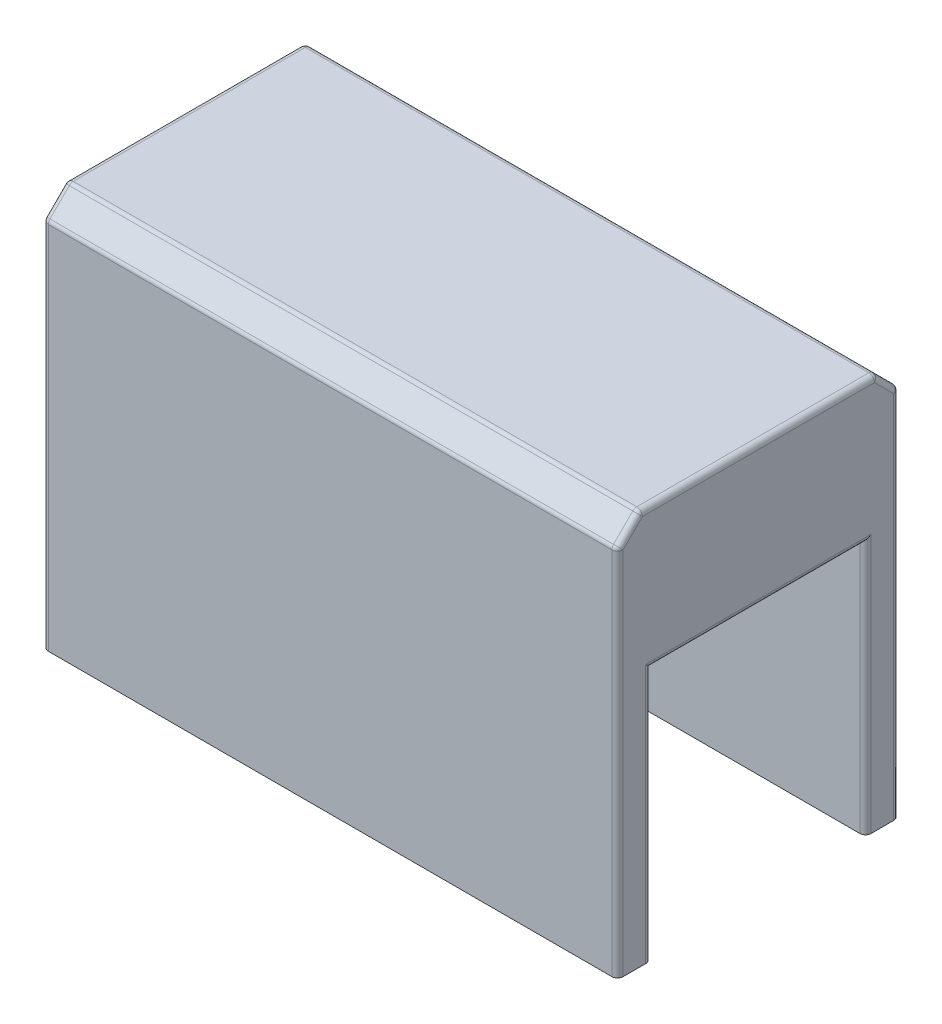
ISO-10303-21;
HEADER;
FILE_DESCRIPTION(('STEP AP214'),'2;1');
FILE_NAME('part.step','',(''),(''),'','','');
FILE_SCHEMA(('AUTOMOTIVE_DESIGN { 1 0 10303 214 1 1 1 1 }'));
ENDSEC;
DATA;
#1=APPLICATION_CONTEXT('core data for automotive mechanical design processes');
#2=APPLICATION_PROTOCOL_DEFINITION('international standard','automotive_design',2000,#1);
#3=PRODUCT_CONTEXT('',#1,'mechanical');
#4=PRODUCT('Part','Part','',(#3));
#5=PRODUCT_RELATED_PRODUCT_CATEGORY('part','',(#4));
#6=PRODUCT_DEFINITION_FORMATION('','',#4);
#7=PRODUCT_DEFINITION_CONTEXT('part definition',#1,'design');
#8=PRODUCT_DEFINITION('design','',#6,#7);
#9=PRODUCT_DEFINITION_SHAPE('','',#8);
#10=(LENGTH_UNIT() NAMED_UNIT(*) SI_UNIT(.MILLI.,.METRE.));
#11=(NAMED_UNIT(*) PLANE_ANGLE_UNIT() SI_UNIT($,.RADIAN.));
#12=(NAMED_UNIT(*) SI_UNIT($,.STERADIAN.) SOLID_ANGLE_UNIT());
#13=UNCERTAINTY_MEASURE_WITH_UNIT(LENGTH_MEASURE(1.E-05),#10,'distance_accuracy_value','');
#14=(GEOMETRIC_REPRESENTATION_CONTEXT(3) GLOBAL_UNCERTAINTY_ASSIGNED_CONTEXT((#13)) GLOBAL_UNIT_ASSIGNED_CONTEXT((#10,
#11,#12)) REPRESENTATION_CONTEXT('',''));
#15=CARTESIAN_POINT('',(0.,0.,0.));
#16=DIRECTION('',(0.,0.,1.));
#17=DIRECTION('',(1.,0.,0.));
#18=AXIS2_PLACEMENT_3D('',#15,#16,#17);
#19=CARTESIAN_POINT('',(-510.,450.,190.));
#20=DIRECTION('',(0.,-1.,0.));
#21=DIRECTION('',(0.,0.,-1.));
#22=AXIS2_PLACEMENT_3D('',#19,#20,#21);
#23=PLANE('',#22);
#24=DIRECTION('',(1.,0.,0.));
#25=VECTOR('',#24,1.);
#26=CARTESIAN_POINT('',(-510.,450.,-190.));
#27=LINE('',#26,#25);
#28=CARTESIAN_POINT('',(-500.,450.,-190.));
#29=VERTEX_POINT('',#28);
#30=CARTESIAN_POINT('',(-450.,450.,-190.));
#31=VERTEX_POINT('',#30);
#32=EDGE_CURVE('E265',#29,#31,#27,.T.);
#33=ORIENTED_EDGE('',*,*,#32,.T.);
#34=DIRECTION('',(0.,0.,1.));
#35=VECTOR('',#34,1.);
#36=CARTESIAN_POINT('',(-450.,450.,190.));
#37=LINE('',#36,#35);
#38=CARTESIAN_POINT('',(-450.,450.,190.));
#39=VERTEX_POINT('',#38);
#40=EDGE_CURVE('E252',#31,#39,#37,.T.);
#41=ORIENTED_EDGE('',*,*,#40,.T.);
#42=DIRECTION('',(1.,0.,0.));
#43=VECTOR('',#42,1.);
#44=CARTESIAN_POINT('',(-510.,450.,190.));
#45=LINE('',#44,#43);
#46=CARTESIAN_POINT('',(-500.,450.,190.));
#47=VERTEX_POINT('',#46);
#48=EDGE_CURVE('E247',#47,#39,#45,.T.);
#49=ORIENTED_EDGE('',*,*,#48,.F.);
#50=DIRECTION('',(0.,0.,-1.));
#51=VECTOR('',#50,1.);
#52=CARTESIAN_POINT('',(-500.,450.,-190.));
#53=LINE('',#52,#51);
#54=EDGE_CURVE('E316',#47,#29,#53,.T.);
#55=ORIENTED_EDGE('',*,*,#54,.T.);
#56=EDGE_LOOP('',(#33,#41,#49,#55));
#57=FACE_BOUND('',#56,.T.);
#58=ADVANCED_FACE('F40',(#57),#23,.T.);
#59=CARTESIAN_POINT('',(450.,450.,190.));
#60=VERTEX_POINT('',#59);
#61=CARTESIAN_POINT('',(500.,450.,190.));
#62=VERTEX_POINT('',#61);
#63=EDGE_CURVE('E264',#60,#62,#45,.T.);
#64=ORIENTED_EDGE('',*,*,#63,.F.);
#65=DIRECTION('',(0.,0.,-1.));
#66=VECTOR('',#65,1.);
#67=CARTESIAN_POINT('',(450.,450.,190.));
#68=LINE('',#67,#66);
#69=CARTESIAN_POINT('',(450.,450.,-190.));
#70=VERTEX_POINT('',#69);
#71=EDGE_CURVE('E248',#60,#70,#68,.T.);
#72=ORIENTED_EDGE('',*,*,#71,.T.);
#73=CARTESIAN_POINT('',(500.,450.,-190.));
#74=VERTEX_POINT('',#73);
#75=EDGE_CURVE('E268',#70,#74,#27,.T.);
#76=ORIENTED_EDGE('',*,*,#75,.T.);
#77=DIRECTION('',(0.,0.,-1.));
#78=VECTOR('',#77,1.);
#79=CARTESIAN_POINT('',(500.,450.,190.));
#80=LINE('',#79,#78);
#81=EDGE_CURVE('E318',#74,#62,#80,.F.);
#82=ORIENTED_EDGE('',*,*,#81,.T.);
#83=EDGE_LOOP('',(#64,#72,#76,#82));
#84=FACE_BOUND('',#83,.T.);
#85=ADVANCED_FACE('F581',(#84),#23,.T.);
#86=CARTESIAN_POINT('',(0.,0.,0.));
#87=DIRECTION('',(0.,1.,0.));
#88=DIRECTION('',(0.,0.,1.));
#89=AXIS2_PLACEMENT_3D('',#86,#87,#88);
#90=PLANE('',#89);
#91=DIRECTION('',(-1.,0.,0.));
#92=VECTOR('',#91,1.);
#93=CARTESIAN_POINT('',(-510.,0.,-250.));
#94=LINE('',#93,#92);
#95=CARTESIAN_POINT('',(500.,0.,-250.));
#96=VERTEX_POINT('',#95);
#97=CARTESIAN_POINT('',(-500.,0.,-250.));
#98=VERTEX_POINT('',#97);
#99=EDGE_CURVE('E275',#96,#98,#94,.T.);
#100=ORIENTED_EDGE('',*,*,#99,.F.);
#101=CARTESIAN_POINT('',(500.,0.,-240.));
#102=DIRECTION('',(0.,1.,0.));
#103=DIRECTION('',(0.,0.,1.));
#104=AXIS2_PLACEMENT_3D('',#101,#102,#103);
#105=CIRCLE('',#104,10.);
#106=CARTESIAN_POINT('',(510.,0.,-240.));
#107=VERTEX_POINT('',#106);
#108=EDGE_CURVE('E297',#96,#107,#105,.F.);
#109=ORIENTED_EDGE('',*,*,#108,.T.);
#110=DIRECTION('',(0.,0.,-1.));
#111=VECTOR('',#110,1.);
#112=CARTESIAN_POINT('',(510.,0.,-250.));
#113=LINE('',#112,#111);
#114=CARTESIAN_POINT('',(510.,0.,-200.));
#115=VERTEX_POINT('',#114);
#116=EDGE_CURVE('E262',#115,#107,#113,.T.);
#117=ORIENTED_EDGE('',*,*,#116,.F.);
#118=CARTESIAN_POINT('',(500.,0.,-200.));
#119=DIRECTION('',(0.,1.,0.));
#120=DIRECTION('',(0.,0.,1.));
#121=AXIS2_PLACEMENT_3D('',#118,#119,#120);
#122=CIRCLE('',#121,10.);
#123=CARTESIAN_POINT('',(500.,0.,-190.));
#124=VERTEX_POINT('',#123);
#125=EDGE_CURVE('E294',#115,#124,#122,.F.);
#126=ORIENTED_EDGE('',*,*,#125,.T.);
#127=DIRECTION('',(1.,0.,0.));
#128=VECTOR('',#127,1.);
#129=CARTESIAN_POINT('',(-510.,0.,-190.));
#130=LINE('',#129,#128);
#131=CARTESIAN_POINT('',(-500.,0.,-190.));
#132=VERTEX_POINT('',#131);
#133=EDGE_CURVE('E269',#132,#124,#130,.T.);
#134=ORIENTED_EDGE('',*,*,#133,.F.);
#135=CARTESIAN_POINT('',(-500.,0.,-200.));
#136=DIRECTION('',(0.,1.,0.));
#137=DIRECTION('',(0.,0.,1.));
#138=AXIS2_PLACEMENT_3D('',#135,#136,#137);
#139=CIRCLE('',#138,10.);
#140=CARTESIAN_POINT('',(-510.,0.,-200.));
#141=VERTEX_POINT('',#140);
#142=EDGE_CURVE('E292',#132,#141,#139,.F.);
#143=ORIENTED_EDGE('',*,*,#142,.T.);
#144=DIRECTION('',(0.,0.,1.));
#145=VECTOR('',#144,1.);
#146=CARTESIAN_POINT('',(-510.,0.,-250.));
#147=LINE('',#146,#145);
#148=CARTESIAN_POINT('',(-510.,0.,-240.));
#149=VERTEX_POINT('',#148);
#150=EDGE_CURVE('E281',#149,#141,#147,.T.);
#151=ORIENTED_EDGE('',*,*,#150,.F.);
#152=CARTESIAN_POINT('',(-500.,0.,-240.));
#153=DIRECTION('',(0.,1.,0.));
#154=DIRECTION('',(0.,0.,1.));
#155=AXIS2_PLACEMENT_3D('',#152,#153,#154);
#156=CIRCLE('',#155,10.);
#157=EDGE_CURVE('E290',#149,#98,#156,.F.);
#158=ORIENTED_EDGE('',*,*,#157,.T.);
#159=EDGE_LOOP('',(#100,#109,#117,#126,#134,#143,#151,#158));
#160=FACE_BOUND('',#159,.T.);
#161=ADVANCED_FACE('F554',(#160),#90,.F.);
#162=CARTESIAN_POINT('',(510.,700.,-250.));
#163=DIRECTION('',(-1.,0.,0.));
#164=DIRECTION('',(0.,0.,1.));
#165=AXIS2_PLACEMENT_3D('',#162,#163,#164);
#166=PLANE('',#165);
#167=DIRECTION('',(0.,-1.,0.));
#168=VECTOR('',#167,1.);
#169=CARTESIAN_POINT('',(510.,700.,-240.));
#170=LINE('',#169,#168);
#171=CARTESIAN_POINT('',(510.,655.857864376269,-240.));
#172=VERTEX_POINT('',#171);
#173=EDGE_CURVE('E308',#107,#172,#170,.F.);
#174=ORIENTED_EDGE('',*,*,#173,.T.);
#175=DIRECTION('',(0.,0.707106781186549,0.707106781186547));
#176=VECTOR('',#175,1.);
#177=CARTESIAN_POINT('',(510.,692.928932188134,-202.928932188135));
#178=LINE('',#177,#176);
#179=CARTESIAN_POINT('',(510.,690.,-205.857864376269));
#180=VERTEX_POINT('',#179);
#181=EDGE_CURVE('E423',#172,#180,#178,.T.);
#182=ORIENTED_EDGE('',*,*,#181,.T.);
#183=DIRECTION('',(0.,0.,-1.));
#184=VECTOR('',#183,1.);
#185=CARTESIAN_POINT('',(510.,690.,195.857864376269));
#186=LINE('',#185,#184);
#187=CARTESIAN_POINT('',(510.,690.,205.857864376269));
#188=VERTEX_POINT('',#187);
#189=EDGE_CURVE('E421',#180,#188,#186,.F.);
#190=ORIENTED_EDGE('',*,*,#189,.T.);
#191=DIRECTION('',(0.,-0.707106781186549,0.707106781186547));
#192=VECTOR('',#191,1.);
#193=CARTESIAN_POINT('',(510.,662.928932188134,232.928932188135));
#194=LINE('',#193,#192);
#195=CARTESIAN_POINT('',(510.,655.857864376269,240.));
#196=VERTEX_POINT('',#195);
#197=EDGE_CURVE('E350',#188,#196,#194,.T.);
#198=ORIENTED_EDGE('',*,*,#197,.T.);
#199=DIRECTION('',(0.,-1.,0.));
#200=VECTOR('',#199,1.);
#201=CARTESIAN_POINT('',(510.,700.,240.));
#202=LINE('',#201,#200);
#203=CARTESIAN_POINT('',(510.,0.,240.));
#204=VERTEX_POINT('',#203);
#205=EDGE_CURVE('E299',#196,#204,#202,.T.);
#206=ORIENTED_EDGE('',*,*,#205,.T.);
#207=CARTESIAN_POINT('',(510.,0.,200.));
#208=VERTEX_POINT('',#207);
#209=EDGE_CURVE('E272',#204,#208,#113,.T.);
#210=ORIENTED_EDGE('',*,*,#209,.T.);
#211=DIRECTION('',(0.,-1.,0.));
#212=VECTOR('',#211,1.);
#213=CARTESIAN_POINT('',(510.,700.,200.));
#214=LINE('',#213,#212);
#215=CARTESIAN_POINT('',(510.,460.,200.));
#216=VERTEX_POINT('',#215);
#217=EDGE_CURVE('E301',#208,#216,#214,.F.);
#218=ORIENTED_EDGE('',*,*,#217,.T.);
#219=DIRECTION('',(0.,0.,-1.));
#220=VECTOR('',#219,1.);
#221=CARTESIAN_POINT('',(510.,460.,-190.));
#222=LINE('',#221,#220);
#223=CARTESIAN_POINT('',(510.,460.,-200.));
#224=VERTEX_POINT('',#223);
#225=EDGE_CURVE('E303',#216,#224,#222,.T.);
#226=ORIENTED_EDGE('',*,*,#225,.T.);
#227=DIRECTION('',(0.,-1.,0.));
#228=VECTOR('',#227,1.);
#229=CARTESIAN_POINT('',(510.,0.,-200.));
#230=LINE('',#229,#228);
#231=EDGE_CURVE('E305',#224,#115,#230,.T.);
#232=ORIENTED_EDGE('',*,*,#231,.T.);
#233=ORIENTED_EDGE('',*,*,#116,.T.);
#234=EDGE_LOOP('',(#174,#182,#190,#198,#206,#210,#218,#226,#232,#233));
#235=FACE_BOUND('',#234,.T.);
#236=ADVANCED_FACE('F510',(#235),#166,.F.);
#237=CARTESIAN_POINT('',(-510.,700.,-250.));
#238=DIRECTION('',(0.,0.,1.));
#239=DIRECTION('',(1.,0.,0.));
#240=AXIS2_PLACEMENT_3D('',#237,#238,#239);
#241=PLANE('',#240);
#242=DIRECTION('',(0.,-1.,0.));
#243=VECTOR('',#242,1.);
#244=CARTESIAN_POINT('',(-500.,700.,-250.));
#245=LINE('',#244,#243);
#246=CARTESIAN_POINT('',(-500.,655.857864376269,-250.));
#247=VERTEX_POINT('',#246);
#248=EDGE_CURVE('E285',#98,#247,#245,.F.);
#249=ORIENTED_EDGE('',*,*,#248,.T.);
#250=DIRECTION('',(1.,0.,0.));
#251=VECTOR('',#250,1.);
#252=CARTESIAN_POINT('',(500.,655.857864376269,-250.));
#253=LINE('',#252,#251);
#254=CARTESIAN_POINT('',(500.,655.857864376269,-250.));
#255=VERTEX_POINT('',#254);
#256=EDGE_CURVE('E11',#247,#255,#253,.T.);
#257=ORIENTED_EDGE('',*,*,#256,.T.);
#258=DIRECTION('',(0.,-1.,0.));
#259=VECTOR('',#258,1.);
#260=CARTESIAN_POINT('',(500.,700.,-250.));
#261=LINE('',#260,#259);
#262=EDGE_CURVE('E288',#255,#96,#261,.T.);
#263=ORIENTED_EDGE('',*,*,#262,.T.);
#264=ORIENTED_EDGE('',*,*,#99,.T.);
#265=EDGE_LOOP('',(#249,#257,#263,#264));
#266=FACE_BOUND('',#265,.T.);
#267=ADVANCED_FACE('F561',(#266),#241,.F.);
#268=CARTESIAN_POINT('',(-510.,700.,-250.));
#269=DIRECTION('',(1.,0.,0.));
#270=DIRECTION('',(0.,0.,-1.));
#271=AXIS2_PLACEMENT_3D('',#268,#269,#270);
#272=PLANE('',#271);
#273=DIRECTION('',(0.,0.,1.));
#274=VECTOR('',#273,1.);
#275=CARTESIAN_POINT('',(-510.,690.,-210.));
#276=LINE('',#275,#274);
#277=CARTESIAN_POINT('',(-510.,690.,205.857864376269));
#278=VERTEX_POINT('',#277);
#279=CARTESIAN_POINT('',(-510.,690.,-205.857864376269));
#280=VERTEX_POINT('',#279);
#281=EDGE_CURVE('E406',#278,#280,#276,.F.);
#282=ORIENTED_EDGE('',*,*,#281,.T.);
#283=DIRECTION('',(0.,-0.707106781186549,-0.707106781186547));
#284=VECTOR('',#283,1.);
#285=CARTESIAN_POINT('',(-510.,662.928932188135,-232.928932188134));
#286=LINE('',#285,#284);
#287=CARTESIAN_POINT('',(-510.,655.857864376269,-240.));
#288=VERTEX_POINT('',#287);
#289=EDGE_CURVE('E408',#280,#288,#286,.T.);
#290=ORIENTED_EDGE('',*,*,#289,.T.);
#291=DIRECTION('',(0.,-1.,0.));
#292=VECTOR('',#291,1.);
#293=CARTESIAN_POINT('',(-510.,700.,-240.));
#294=LINE('',#293,#292);
#295=EDGE_CURVE('E345',#288,#149,#294,.T.);
#296=ORIENTED_EDGE('',*,*,#295,.T.);
#297=ORIENTED_EDGE('',*,*,#150,.T.);
#298=DIRECTION('',(0.,-1.,0.));
#299=VECTOR('',#298,1.);
#300=CARTESIAN_POINT('',(-510.,450.,-200.));
#301=LINE('',#300,#299);
#302=CARTESIAN_POINT('',(-510.,460.,-200.));
#303=VERTEX_POINT('',#302);
#304=EDGE_CURVE('E340',#141,#303,#301,.F.);
#305=ORIENTED_EDGE('',*,*,#304,.T.);
#306=DIRECTION('',(0.,0.,-1.));
#307=VECTOR('',#306,1.);
#308=CARTESIAN_POINT('',(-510.,460.,190.));
#309=LINE('',#308,#307);
#310=CARTESIAN_POINT('',(-510.,460.,200.));
#311=VERTEX_POINT('',#310);
#312=EDGE_CURVE('E338',#303,#311,#309,.F.);
#313=ORIENTED_EDGE('',*,*,#312,.T.);
#314=DIRECTION('',(0.,-1.,0.));
#315=VECTOR('',#314,1.);
#316=CARTESIAN_POINT('',(-510.,700.,200.));
#317=LINE('',#316,#315);
#318=CARTESIAN_POINT('',(-510.,0.,200.));
#319=VERTEX_POINT('',#318);
#320=EDGE_CURVE('E342',#311,#319,#317,.T.);
#321=ORIENTED_EDGE('',*,*,#320,.T.);
#322=CARTESIAN_POINT('',(-510.,0.,240.));
#323=VERTEX_POINT('',#322);
#324=EDGE_CURVE('E278',#319,#323,#147,.T.);
#325=ORIENTED_EDGE('',*,*,#324,.T.);
#326=DIRECTION('',(0.,-1.,0.));
#327=VECTOR('',#326,1.);
#328=CARTESIAN_POINT('',(-510.,700.,240.));
#329=LINE('',#328,#327);
#330=CARTESIAN_POINT('',(-510.,655.857864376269,240.));
#331=VERTEX_POINT('',#330);
#332=EDGE_CURVE('E347',#323,#331,#329,.F.);
#333=ORIENTED_EDGE('',*,*,#332,.T.);
#334=DIRECTION('',(0.,0.707106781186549,-0.707106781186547));
#335=VECTOR('',#334,1.);
#336=CARTESIAN_POINT('',(-510.,692.928932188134,202.928932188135));
#337=LINE('',#336,#335);
#338=EDGE_CURVE('E379',#331,#278,#337,.T.);
#339=ORIENTED_EDGE('',*,*,#338,.T.);
#340=EDGE_LOOP('',(#282,#290,#296,#297,#305,#313,#321,#325,#333,#339));
#341=FACE_BOUND('',#340,.T.);
#342=ADVANCED_FACE('F603',(#341),#272,.F.);
#343=CARTESIAN_POINT('',(-510.,700.,250.));
#344=DIRECTION('',(0.,0.,-1.));
#345=DIRECTION('',(-1.,0.,0.));
#346=AXIS2_PLACEMENT_3D('',#343,#344,#345);
#347=PLANE('',#346);
#348=DIRECTION('',(0.,-1.,0.));
#349=VECTOR('',#348,1.);
#350=CARTESIAN_POINT('',(500.,700.,250.));
#351=LINE('',#350,#349);
#352=CARTESIAN_POINT('',(500.,0.,250.));
#353=VERTEX_POINT('',#352);
#354=CARTESIAN_POINT('',(500.,655.857864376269,250.));
#355=VERTEX_POINT('',#354);
#356=EDGE_CURVE('E335',#353,#355,#351,.F.);
#357=ORIENTED_EDGE('',*,*,#356,.T.);
#358=DIRECTION('',(-1.,0.,0.));
#359=VECTOR('',#358,1.);
#360=CARTESIAN_POINT('',(-500.,655.857864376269,250.));
#361=LINE('',#360,#359);
#362=CARTESIAN_POINT('',(-500.,655.857864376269,250.));
#363=VERTEX_POINT('',#362);
#364=EDGE_CURVE('E384',#355,#363,#361,.T.);
#365=ORIENTED_EDGE('',*,*,#364,.T.);
#366=DIRECTION('',(0.,-1.,0.));
#367=VECTOR('',#366,1.);
#368=CARTESIAN_POINT('',(-500.,700.,250.));
#369=LINE('',#368,#367);
#370=CARTESIAN_POINT('',(-500.,0.,250.));
#371=VERTEX_POINT('',#370);
#372=EDGE_CURVE('E333',#363,#371,#369,.T.);
#373=ORIENTED_EDGE('',*,*,#372,.T.);
#374=DIRECTION('',(1.,0.,0.));
#375=VECTOR('',#374,1.);
#376=CARTESIAN_POINT('',(-510.,0.,250.));
#377=LINE('',#376,#375);
#378=EDGE_CURVE('E282',#371,#353,#377,.T.);
#379=ORIENTED_EDGE('',*,*,#378,.T.);
#380=EDGE_LOOP('',(#357,#365,#373,#379));
#381=FACE_BOUND('',#380,.T.);
#382=ADVANCED_FACE('F597',(#381),#347,.F.);
#383=CARTESIAN_POINT('',(0.,700.,0.));
#384=DIRECTION('',(0.,1.,0.));
#385=DIRECTION('',(0.,0.,1.));
#386=AXIS2_PLACEMENT_3D('',#383,#384,#385);
#387=PLANE('',#386);
#388=DIRECTION('',(1.,0.,0.));
#389=VECTOR('',#388,1.);
#390=CARTESIAN_POINT('',(0.,700.,205.857864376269));
#391=LINE('',#390,#389);
#392=CARTESIAN_POINT('',(-500.,700.,205.857864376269));
#393=VERTEX_POINT('',#392);
#394=CARTESIAN_POINT('',(500.,700.,205.857864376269));
#395=VERTEX_POINT('',#394);
#396=EDGE_CURVE('E374',#393,#395,#391,.T.);
#397=ORIENTED_EDGE('',*,*,#396,.T.);
#398=DIRECTION('',(0.,0.,-1.));
#399=VECTOR('',#398,1.);
#400=CARTESIAN_POINT('',(500.,700.,-210.));
#401=LINE('',#400,#399);
#402=CARTESIAN_POINT('',(500.,700.,-205.857864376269));
#403=VERTEX_POINT('',#402);
#404=EDGE_CURVE('E49',#395,#403,#401,.T.);
#405=ORIENTED_EDGE('',*,*,#404,.T.);
#406=DIRECTION('',(-1.,0.,0.));
#407=VECTOR('',#406,1.);
#408=CARTESIAN_POINT('',(0.,700.,-205.857864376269));
#409=LINE('',#408,#407);
#410=CARTESIAN_POINT('',(-500.,700.,-205.857864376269));
#411=VERTEX_POINT('',#410);
#412=EDGE_CURVE('E65',#403,#411,#409,.T.);
#413=ORIENTED_EDGE('',*,*,#412,.T.);
#414=DIRECTION('',(0.,0.,1.));
#415=VECTOR('',#414,1.);
#416=CARTESIAN_POINT('',(-500.,700.,195.857864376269));
#417=LINE('',#416,#415);
#418=EDGE_CURVE('E428',#411,#393,#417,.T.);
#419=ORIENTED_EDGE('',*,*,#418,.T.);
#420=EDGE_LOOP('',(#397,#405,#413,#419));
#421=FACE_BOUND('',#420,.T.);
#422=ADVANCED_FACE('F519',(#421),#387,.T.);
#423=DIRECTION('',(1.,0.,0.));
#424=VECTOR('',#423,1.);
#425=CARTESIAN_POINT('',(-510.,0.,190.));
#426=LINE('',#425,#424);
#427=CARTESIAN_POINT('',(-500.,0.,190.));
#428=VERTEX_POINT('',#427);
#429=CARTESIAN_POINT('',(500.,0.,190.));
#430=VERTEX_POINT('',#429);
#431=EDGE_CURVE('E260',#428,#430,#426,.T.);
#432=ORIENTED_EDGE('',*,*,#431,.T.);
#433=CARTESIAN_POINT('',(500.,0.,200.));
#434=DIRECTION('',(0.,1.,0.));
#435=DIRECTION('',(0.,0.,1.));
#436=AXIS2_PLACEMENT_3D('',#433,#434,#435);
#437=CIRCLE('',#436,10.);
#438=EDGE_CURVE('E331',#430,#208,#437,.F.);
#439=ORIENTED_EDGE('',*,*,#438,.T.);
#440=ORIENTED_EDGE('',*,*,#209,.F.);
#441=CARTESIAN_POINT('',(500.,0.,240.));
#442=DIRECTION('',(0.,1.,0.));
#443=DIRECTION('',(0.,0.,1.));
#444=AXIS2_PLACEMENT_3D('',#441,#442,#443);
#445=CIRCLE('',#444,10.);
#446=EDGE_CURVE('E329',#204,#353,#445,.F.);
#447=ORIENTED_EDGE('',*,*,#446,.T.);
#448=ORIENTED_EDGE('',*,*,#378,.F.);
#449=CARTESIAN_POINT('',(-500.,0.,240.));
#450=DIRECTION('',(0.,1.,0.));
#451=DIRECTION('',(0.,0.,1.));
#452=AXIS2_PLACEMENT_3D('',#449,#450,#451);
#453=CIRCLE('',#452,10.);
#454=EDGE_CURVE('E327',#371,#323,#453,.F.);
#455=ORIENTED_EDGE('',*,*,#454,.T.);
#456=ORIENTED_EDGE('',*,*,#324,.F.);
#457=CARTESIAN_POINT('',(-500.,0.,200.));
#458=DIRECTION('',(0.,1.,0.));
#459=DIRECTION('',(0.,0.,1.));
#460=AXIS2_PLACEMENT_3D('',#457,#458,#459);
#461=CIRCLE('',#460,10.);
#462=EDGE_CURVE('E325',#319,#428,#461,.F.);
#463=ORIENTED_EDGE('',*,*,#462,.T.);
#464=EDGE_LOOP('',(#432,#439,#440,#447,#448,#455,#456,#463));
#465=FACE_BOUND('',#464,.T.);
#466=ADVANCED_FACE('F596',(#465),#90,.F.);
#467=CARTESIAN_POINT('',(-510.,450.,190.));
#468=DIRECTION('',(0.,0.,1.));
#469=DIRECTION('',(0.,-1.,0.));
#470=AXIS2_PLACEMENT_3D('',#467,#468,#469);
#471=PLANE('',#470);
#472=DIRECTION('',(0.,-1.,0.));
#473=VECTOR('',#472,1.);
#474=CARTESIAN_POINT('',(500.,450.,190.));
#475=LINE('',#474,#473);
#476=EDGE_CURVE('E323',#62,#430,#475,.T.);
#477=ORIENTED_EDGE('',*,*,#476,.T.);
#478=ORIENTED_EDGE('',*,*,#431,.F.);
#479=DIRECTION('',(0.,-1.,0.));
#480=VECTOR('',#479,1.);
#481=CARTESIAN_POINT('',(-500.,450.,190.));
#482=LINE('',#481,#480);
#483=EDGE_CURVE('E321',#428,#47,#482,.F.);
#484=ORIENTED_EDGE('',*,*,#483,.T.);
#485=ORIENTED_EDGE('',*,*,#48,.T.);
#486=DIRECTION('',(0.,-1.,0.));
#487=VECTOR('',#486,1.);
#488=CARTESIAN_POINT('',(-450.,640.,190.));
#489=LINE('',#488,#487);
#490=CARTESIAN_POINT('',(-450.,640.,190.));
#491=VERTEX_POINT('',#490);
#492=EDGE_CURVE('E240',#491,#39,#489,.T.);
#493=ORIENTED_EDGE('',*,*,#492,.F.);
#494=DIRECTION('',(1.,0.,0.));
#495=VECTOR('',#494,1.);
#496=CARTESIAN_POINT('',(450.,640.,190.));
#497=LINE('',#496,#495);
#498=CARTESIAN_POINT('',(450.,640.,190.));
#499=VERTEX_POINT('',#498);
#500=EDGE_CURVE('E227',#491,#499,#497,.T.);
#501=ORIENTED_EDGE('',*,*,#500,.T.);
#502=DIRECTION('',(0.,-1.,0.));
#503=VECTOR('',#502,1.);
#504=CARTESIAN_POINT('',(450.,640.,190.));
#505=LINE('',#504,#503);
#506=EDGE_CURVE('E249',#499,#60,#505,.T.);
#507=ORIENTED_EDGE('',*,*,#506,.T.);
#508=ORIENTED_EDGE('',*,*,#63,.T.);
#509=EDGE_LOOP('',(#477,#478,#484,#485,#493,#501,#507,#508));
#510=FACE_BOUND('',#509,.T.);
#511=ADVANCED_FACE('F245',(#510),#471,.F.);
#512=CARTESIAN_POINT('',(-510.,450.,-190.));
#513=DIRECTION('',(0.,0.,1.));
#514=DIRECTION('',(1.,0.,0.));
#515=AXIS2_PLACEMENT_3D('',#512,#513,#514);
#516=PLANE('',#515);
#517=ORIENTED_EDGE('',*,*,#75,.F.);
#518=DIRECTION('',(0.,-1.,0.));
#519=VECTOR('',#518,1.);
#520=CARTESIAN_POINT('',(450.,640.,-190.));
#521=LINE('',#520,#519);
#522=CARTESIAN_POINT('',(450.,640.,-190.));
#523=VERTEX_POINT('',#522);
#524=EDGE_CURVE('E254',#523,#70,#521,.T.);
#525=ORIENTED_EDGE('',*,*,#524,.F.);
#526=DIRECTION('',(-1.,0.,0.));
#527=VECTOR('',#526,1.);
#528=CARTESIAN_POINT('',(450.,640.,-190.));
#529=LINE('',#528,#527);
#530=CARTESIAN_POINT('',(-450.,640.,-190.));
#531=VERTEX_POINT('',#530);
#532=EDGE_CURVE('E994',#523,#531,#529,.T.);
#533=ORIENTED_EDGE('',*,*,#532,.T.);
#534=DIRECTION('',(0.,-1.,0.));
#535=VECTOR('',#534,1.);
#536=CARTESIAN_POINT('',(-450.,640.,-190.));
#537=LINE('',#536,#535);
#538=EDGE_CURVE('E57',#531,#31,#537,.T.);
#539=ORIENTED_EDGE('',*,*,#538,.T.);
#540=ORIENTED_EDGE('',*,*,#32,.F.);
#541=DIRECTION('',(0.,-1.,0.));
#542=VECTOR('',#541,1.);
#543=CARTESIAN_POINT('',(-500.,0.,-190.));
#544=LINE('',#543,#542);
#545=EDGE_CURVE('E311',#29,#132,#544,.T.);
#546=ORIENTED_EDGE('',*,*,#545,.T.);
#547=ORIENTED_EDGE('',*,*,#133,.T.);
#548=DIRECTION('',(0.,-1.,0.));
#549=VECTOR('',#548,1.);
#550=CARTESIAN_POINT('',(500.,450.,-190.));
#551=LINE('',#550,#549);
#552=EDGE_CURVE('E313',#124,#74,#551,.F.);
#553=ORIENTED_EDGE('',*,*,#552,.T.);
#554=EDGE_LOOP('',(#517,#525,#533,#539,#540,#546,#547,#553));
#555=FACE_BOUND('',#554,.T.);
#556=ADVANCED_FACE('F591',(#555),#516,.T.);
#557=CARTESIAN_POINT('',(0.,700.,-210.));
#558=DIRECTION('',(0.,0.707106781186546,-0.707106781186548));
#559=DIRECTION('',(1.,0.,0.));
#560=AXIS2_PLACEMENT_3D('',#557,#558,#559);
#561=PLANE('',#560);
#562=DIRECTION('',(0.,0.707106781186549,0.707106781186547));
#563=VECTOR('',#562,1.);
#564=CARTESIAN_POINT('',(500.,670.,-240.));
#565=LINE('',#564,#563);
#566=CARTESIAN_POINT('',(500.,697.071067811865,-212.928932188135));
#567=VERTEX_POINT('',#566);
#568=CARTESIAN_POINT('',(500.,662.928932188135,-247.071067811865));
#569=VERTEX_POINT('',#568);
#570=EDGE_CURVE('E412',#567,#569,#565,.F.);
#571=ORIENTED_EDGE('',*,*,#570,.T.);
#572=DIRECTION('',(1.,0.,0.));
#573=VECTOR('',#572,1.);
#574=CARTESIAN_POINT('',(-500.,662.928932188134,-247.071067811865));
#575=LINE('',#574,#573);
#576=CARTESIAN_POINT('',(-500.,662.928932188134,-247.071067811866));
#577=VERTEX_POINT('',#576);
#578=EDGE_CURVE('E417',#569,#577,#575,.F.);
#579=ORIENTED_EDGE('',*,*,#578,.T.);
#580=DIRECTION('',(0.,-0.707106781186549,-0.707106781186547));
#581=VECTOR('',#580,1.);
#582=CARTESIAN_POINT('',(-500.,700.,-210.));
#583=LINE('',#582,#581);
#584=CARTESIAN_POINT('',(-500.,697.071067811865,-212.928932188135));
#585=VERTEX_POINT('',#584);
#586=EDGE_CURVE('E414',#577,#585,#583,.F.);
#587=ORIENTED_EDGE('',*,*,#586,.T.);
#588=DIRECTION('',(-1.,0.,0.));
#589=VECTOR('',#588,1.);
#590=CARTESIAN_POINT('',(0.,697.071067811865,-212.928932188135));
#591=LINE('',#590,#589);
#592=EDGE_CURVE('E410',#585,#567,#591,.F.);
#593=ORIENTED_EDGE('',*,*,#592,.T.);
#594=EDGE_LOOP('',(#571,#579,#587,#593));
#595=FACE_BOUND('',#594,.T.);
#596=ADVANCED_FACE('F535',(#595),#561,.T.);
#597=CARTESIAN_POINT('',(0.,700.,210.));
#598=DIRECTION('',(0.,0.707106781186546,0.707106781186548));
#599=DIRECTION('',(-1.,0.,0.));
#600=AXIS2_PLACEMENT_3D('',#597,#598,#599);
#601=PLANE('',#600);
#602=DIRECTION('',(0.,-0.707106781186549,0.707106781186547));
#603=VECTOR('',#602,1.);
#604=CARTESIAN_POINT('',(500.,700.,210.));
#605=LINE('',#604,#603);
#606=CARTESIAN_POINT('',(500.,662.928932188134,247.071067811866));
#607=VERTEX_POINT('',#606);
#608=CARTESIAN_POINT('',(500.,697.071067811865,212.928932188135));
#609=VERTEX_POINT('',#608);
#610=EDGE_CURVE('E368',#607,#609,#605,.F.);
#611=ORIENTED_EDGE('',*,*,#610,.T.);
#612=DIRECTION('',(1.,0.,0.));
#613=VECTOR('',#612,1.);
#614=CARTESIAN_POINT('',(0.,697.071067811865,212.928932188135));
#615=LINE('',#614,#613);
#616=CARTESIAN_POINT('',(-500.,697.071067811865,212.928932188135));
#617=VERTEX_POINT('',#616);
#618=EDGE_CURVE('E371',#609,#617,#615,.F.);
#619=ORIENTED_EDGE('',*,*,#618,.T.);
#620=DIRECTION('',(0.,0.707106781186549,-0.707106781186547));
#621=VECTOR('',#620,1.);
#622=CARTESIAN_POINT('',(-500.,670.,240.));
#623=LINE('',#622,#621);
#624=CARTESIAN_POINT('',(-500.,662.928932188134,247.071067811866));
#625=VERTEX_POINT('',#624);
#626=EDGE_CURVE('E366',#617,#625,#623,.F.);
#627=ORIENTED_EDGE('',*,*,#626,.T.);
#628=DIRECTION('',(-1.,0.,0.));
#629=VECTOR('',#628,1.);
#630=CARTESIAN_POINT('',(500.,662.928932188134,247.071067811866));
#631=LINE('',#630,#629);
#632=EDGE_CURVE('E364',#625,#607,#631,.F.);
#633=ORIENTED_EDGE('',*,*,#632,.T.);
#634=EDGE_LOOP('',(#611,#619,#627,#633));
#635=FACE_BOUND('',#634,.T.);
#636=ADVANCED_FACE('F480',(#635),#601,.T.);
#637=CARTESIAN_POINT('',(500.,700.,-240.));
#638=DIRECTION('',(0.,-1.,0.));
#639=DIRECTION('',(0.,0.,-1.));
#640=AXIS2_PLACEMENT_3D('',#637,#638,#639);
#641=CYLINDRICAL_SURFACE('',#640,10.);
#642=ORIENTED_EDGE('',*,*,#262,.F.);
#643=CARTESIAN_POINT('',(500.,655.857864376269,-240.));
#644=DIRECTION('',(0.,-1.,0.));
#645=DIRECTION('',(0.,0.,-1.));
#646=AXIS2_PLACEMENT_3D('',#643,#644,#645);
#647=CIRCLE('',#646,10.);
#648=EDGE_CURVE('E425',#255,#172,#647,.T.);
#649=ORIENTED_EDGE('',*,*,#648,.T.);
#650=ORIENTED_EDGE('',*,*,#173,.F.);
#651=ORIENTED_EDGE('',*,*,#108,.F.);
#652=EDGE_LOOP('',(#642,#649,#650,#651));
#653=FACE_BOUND('',#652,.T.);
#654=ADVANCED_FACE('F547',(#653),#641,.T.);
#655=CARTESIAN_POINT('',(500.,450.,200.));
#656=DIRECTION('',(0.,-1.,0.));
#657=DIRECTION('',(0.,0.,-1.));
#658=AXIS2_PLACEMENT_3D('',#655,#656,#657);
#659=CYLINDRICAL_SURFACE('',#658,10.);
#660=ORIENTED_EDGE('',*,*,#438,.F.);
#661=ORIENTED_EDGE('',*,*,#476,.F.);
#662=CARTESIAN_POINT('',(500.,460.,200.));
#663=DIRECTION('',(0.,-0.707106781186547,0.707106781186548));
#664=DIRECTION('',(0.,0.707106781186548,0.707106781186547));
#665=AXIS2_PLACEMENT_3D('',#662,#663,#664);
#666=ELLIPSE('',#665,14.1421356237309,10.);
#667=EDGE_CURVE('E271',#216,#62,#666,.F.);
#668=ORIENTED_EDGE('',*,*,#667,.F.);
#669=ORIENTED_EDGE('',*,*,#217,.F.);
#670=EDGE_LOOP('',(#660,#661,#668,#669));
#671=FACE_BOUND('',#670,.T.);
#672=ADVANCED_FACE('F618',(#671),#659,.T.);
#673=CARTESIAN_POINT('',(500.,460.,-250.));
#674=DIRECTION('',(0.,0.,1.));
#675=DIRECTION('',(1.,0.,0.));
#676=AXIS2_PLACEMENT_3D('',#673,#674,#675);
#677=CYLINDRICAL_SURFACE('',#676,10.);
#678=ORIENTED_EDGE('',*,*,#667,.T.);
#679=ORIENTED_EDGE('',*,*,#81,.F.);
#680=CARTESIAN_POINT('',(500.,460.,-200.));
#681=DIRECTION('',(0.,0.707106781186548,0.707106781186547));
#682=DIRECTION('',(0.,0.707106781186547,-0.707106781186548));
#683=AXIS2_PLACEMENT_3D('',#680,#681,#682);
#684=ELLIPSE('',#683,14.1421356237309,10.);
#685=EDGE_CURVE('E351',#224,#74,#684,.F.);
#686=ORIENTED_EDGE('',*,*,#685,.F.);
#687=ORIENTED_EDGE('',*,*,#225,.F.);
#688=EDGE_LOOP('',(#678,#679,#686,#687));
#689=FACE_BOUND('',#688,.T.);
#690=ADVANCED_FACE('F622',(#689),#677,.T.);
#691=CARTESIAN_POINT('',(500.,700.,-200.));
#692=DIRECTION('',(0.,1.,0.));
#693=DIRECTION('',(0.,0.,1.));
#694=AXIS2_PLACEMENT_3D('',#691,#692,#693);
#695=CYLINDRICAL_SURFACE('',#694,10.);
#696=ORIENTED_EDGE('',*,*,#685,.T.);
#697=ORIENTED_EDGE('',*,*,#552,.F.);
#698=ORIENTED_EDGE('',*,*,#125,.F.);
#699=ORIENTED_EDGE('',*,*,#231,.F.);
#700=EDGE_LOOP('',(#696,#697,#698,#699));
#701=FACE_BOUND('',#700,.T.);
#702=ADVANCED_FACE('F619',(#701),#695,.T.);
#703=CARTESIAN_POINT('',(500.,700.,240.));
#704=DIRECTION('',(0.,-1.,0.));
#705=DIRECTION('',(0.,0.,-1.));
#706=AXIS2_PLACEMENT_3D('',#703,#704,#705);
#707=CYLINDRICAL_SURFACE('',#706,10.);
#708=ORIENTED_EDGE('',*,*,#205,.F.);
#709=CARTESIAN_POINT('',(500.,655.857864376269,240.));
#710=DIRECTION('',(0.,-1.,0.));
#711=DIRECTION('',(0.,0.,-1.));
#712=AXIS2_PLACEMENT_3D('',#709,#710,#711);
#713=CIRCLE('',#712,10.);
#714=EDGE_CURVE('E377',#196,#355,#713,.T.);
#715=ORIENTED_EDGE('',*,*,#714,.T.);
#716=ORIENTED_EDGE('',*,*,#356,.F.);
#717=ORIENTED_EDGE('',*,*,#446,.F.);
#718=EDGE_LOOP('',(#708,#715,#716,#717));
#719=FACE_BOUND('',#718,.T.);
#720=ADVANCED_FACE('F507',(#719),#707,.T.);
#721=CARTESIAN_POINT('',(-500.,700.,240.));
#722=DIRECTION('',(0.,-1.,0.));
#723=DIRECTION('',(0.,0.,-1.));
#724=AXIS2_PLACEMENT_3D('',#721,#722,#723);
#725=CYLINDRICAL_SURFACE('',#724,10.);
#726=ORIENTED_EDGE('',*,*,#372,.F.);
#727=CARTESIAN_POINT('',(-500.,655.857864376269,240.));
#728=DIRECTION('',(0.,-1.,0.));
#729=DIRECTION('',(0.,0.,-1.));
#730=AXIS2_PLACEMENT_3D('',#727,#728,#729);
#731=CIRCLE('',#730,10.);
#732=EDGE_CURVE('E382',#363,#331,#731,.T.);
#733=ORIENTED_EDGE('',*,*,#732,.T.);
#734=ORIENTED_EDGE('',*,*,#332,.F.);
#735=ORIENTED_EDGE('',*,*,#454,.F.);
#736=EDGE_LOOP('',(#726,#733,#734,#735));
#737=FACE_BOUND('',#736,.T.);
#738=ADVANCED_FACE('F632',(#737),#725,.T.);
#739=CARTESIAN_POINT('',(-500.,450.,-200.));
#740=DIRECTION('',(0.,1.,0.));
#741=DIRECTION('',(0.,0.,1.));
#742=AXIS2_PLACEMENT_3D('',#739,#740,#741);
#743=CYLINDRICAL_SURFACE('',#742,10.);
#744=ORIENTED_EDGE('',*,*,#142,.F.);
#745=ORIENTED_EDGE('',*,*,#545,.F.);
#746=CARTESIAN_POINT('',(-500.,460.,-200.));
#747=DIRECTION('',(0.,0.707106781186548,0.707106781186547));
#748=DIRECTION('',(0.,0.707106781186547,-0.707106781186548));
#749=AXIS2_PLACEMENT_3D('',#746,#747,#748);
#750=ELLIPSE('',#749,14.1421356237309,10.);
#751=EDGE_CURVE('E354',#303,#29,#750,.T.);
#752=ORIENTED_EDGE('',*,*,#751,.F.);
#753=ORIENTED_EDGE('',*,*,#304,.F.);
#754=EDGE_LOOP('',(#744,#745,#752,#753));
#755=FACE_BOUND('',#754,.T.);
#756=ADVANCED_FACE('F635',(#755),#743,.T.);
#757=CARTESIAN_POINT('',(-500.,460.,190.));
#758=DIRECTION('',(0.,0.,1.));
#759=DIRECTION('',(1.,0.,0.));
#760=AXIS2_PLACEMENT_3D('',#757,#758,#759);
#761=CYLINDRICAL_SURFACE('',#760,10.);
#762=ORIENTED_EDGE('',*,*,#751,.T.);
#763=ORIENTED_EDGE('',*,*,#54,.F.);
#764=CARTESIAN_POINT('',(-500.,460.,200.));
#765=DIRECTION('',(0.,-0.707106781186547,0.707106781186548));
#766=DIRECTION('',(0.,-0.707106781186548,-0.707106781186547));
#767=AXIS2_PLACEMENT_3D('',#764,#765,#766);
#768=ELLIPSE('',#767,14.1421356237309,10.);
#769=EDGE_CURVE('E357',#311,#47,#768,.T.);
#770=ORIENTED_EDGE('',*,*,#769,.F.);
#771=ORIENTED_EDGE('',*,*,#312,.F.);
#772=EDGE_LOOP('',(#762,#763,#770,#771));
#773=FACE_BOUND('',#772,.T.);
#774=ADVANCED_FACE('F640',(#773),#761,.T.);
#775=CARTESIAN_POINT('',(-500.,700.,200.));
#776=DIRECTION('',(0.,-1.,0.));
#777=DIRECTION('',(0.,0.,-1.));
#778=AXIS2_PLACEMENT_3D('',#775,#776,#777);
#779=CYLINDRICAL_SURFACE('',#778,10.);
#780=ORIENTED_EDGE('',*,*,#769,.T.);
#781=ORIENTED_EDGE('',*,*,#483,.F.);
#782=ORIENTED_EDGE('',*,*,#462,.F.);
#783=ORIENTED_EDGE('',*,*,#320,.F.);
#784=EDGE_LOOP('',(#780,#781,#782,#783));
#785=FACE_BOUND('',#784,.T.);
#786=ADVANCED_FACE('F637',(#785),#779,.T.);
#787=CARTESIAN_POINT('',(-500.,700.,-240.));
#788=DIRECTION('',(0.,-1.,0.));
#789=DIRECTION('',(0.,0.,-1.));
#790=AXIS2_PLACEMENT_3D('',#787,#788,#789);
#791=CYLINDRICAL_SURFACE('',#790,10.);
#792=ORIENTED_EDGE('',*,*,#295,.F.);
#793=CARTESIAN_POINT('',(-500.,655.857864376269,-240.));
#794=DIRECTION('',(0.,-1.,0.));
#795=DIRECTION('',(0.,0.,-1.));
#796=AXIS2_PLACEMENT_3D('',#793,#794,#795);
#797=CIRCLE('',#796,10.);
#798=EDGE_CURVE('E419',#288,#247,#797,.T.);
#799=ORIENTED_EDGE('',*,*,#798,.T.);
#800=ORIENTED_EDGE('',*,*,#248,.F.);
#801=ORIENTED_EDGE('',*,*,#157,.F.);
#802=EDGE_LOOP('',(#792,#799,#800,#801));
#803=FACE_BOUND('',#802,.T.);
#804=ADVANCED_FACE('F564',(#803),#791,.T.);
#805=CARTESIAN_POINT('',(-500.,655.857864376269,240.));
#806=DIRECTION('',(0.,0.707106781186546,0.707106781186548));
#807=DIRECTION('',(0.,-0.707106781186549,0.707106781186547));
#808=AXIS2_PLACEMENT_3D('',#805,#806,#807);
#809=SPHERICAL_SURFACE('',#808,10.);
#810=CARTESIAN_POINT('',(-500.,655.857864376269,240.));
#811=DIRECTION('',(1.,0.,0.));
#812=DIRECTION('',(0.,0.,-1.));
#813=AXIS2_PLACEMENT_3D('',#810,#811,#812);
#814=CIRCLE('',#813,10.);
#815=EDGE_CURVE('E393',#625,#363,#814,.T.);
#816=ORIENTED_EDGE('',*,*,#815,.F.);
#817=CARTESIAN_POINT('',(-500.,655.857864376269,240.));
#818=DIRECTION('',(0.,0.707106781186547,-0.707106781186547));
#819=DIRECTION('',(0.,0.707106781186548,0.707106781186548));
#820=AXIS2_PLACEMENT_3D('',#817,#818,#819);
#821=CIRCLE('',#820,10.);
#822=EDGE_CURVE('E360',#331,#625,#821,.T.);
#823=ORIENTED_EDGE('',*,*,#822,.F.);
#824=ORIENTED_EDGE('',*,*,#732,.F.);
#825=EDGE_LOOP('',(#816,#823,#824));
#826=FACE_BOUND('',#825,.T.);
#827=ADVANCED_FACE('F490',(#826),#809,.T.);
#828=CARTESIAN_POINT('',(-500.,922.928932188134,-27.0710678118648));
#829=DIRECTION('',(0.,-0.707106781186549,0.707106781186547));
#830=DIRECTION('',(0.,-0.707106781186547,-0.707106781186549));
#831=AXIS2_PLACEMENT_3D('',#828,#829,#830);
#832=CYLINDRICAL_SURFACE('',#831,10.);
#833=ORIENTED_EDGE('',*,*,#626,.F.);
#834=CARTESIAN_POINT('',(-500.,690.,205.857864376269));
#835=DIRECTION('',(0.,-0.707106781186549,0.707106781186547));
#836=DIRECTION('',(0.,-0.707106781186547,-0.707106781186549));
#837=AXIS2_PLACEMENT_3D('',#834,#835,#836);
#838=CIRCLE('',#837,10.);
#839=EDGE_CURVE('E404',#617,#278,#838,.T.);
#840=ORIENTED_EDGE('',*,*,#839,.T.);
#841=ORIENTED_EDGE('',*,*,#338,.F.);
#842=ORIENTED_EDGE('',*,*,#822,.T.);
#843=EDGE_LOOP('',(#833,#840,#841,#842));
#844=FACE_BOUND('',#843,.T.);
#845=ADVANCED_FACE('F483',(#844),#832,.T.);
#846=CARTESIAN_POINT('',(-510.,655.857864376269,240.));
#847=DIRECTION('',(1.,0.,0.));
#848=DIRECTION('',(0.,0.,-1.));
#849=AXIS2_PLACEMENT_3D('',#846,#847,#848);
#850=CYLINDRICAL_SURFACE('',#849,10.);
#851=ORIENTED_EDGE('',*,*,#815,.T.);
#852=ORIENTED_EDGE('',*,*,#364,.F.);
#853=CARTESIAN_POINT('',(500.,655.857864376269,240.));
#854=DIRECTION('',(1.,0.,0.));
#855=DIRECTION('',(0.,0.,-1.));
#856=AXIS2_PLACEMENT_3D('',#853,#854,#855);
#857=CIRCLE('',#856,10.);
#858=EDGE_CURVE('E390',#607,#355,#857,.T.);
#859=ORIENTED_EDGE('',*,*,#858,.F.);
#860=ORIENTED_EDGE('',*,*,#632,.F.);
#861=EDGE_LOOP('',(#851,#852,#859,#860));
#862=FACE_BOUND('',#861,.T.);
#863=ADVANCED_FACE('F494',(#862),#850,.T.);
#864=CARTESIAN_POINT('',(0.,690.,205.857864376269));
#865=DIRECTION('',(1.,0.,0.));
#866=DIRECTION('',(0.,0.,-1.));
#867=AXIS2_PLACEMENT_3D('',#864,#865,#866);
#868=CYLINDRICAL_SURFACE('',#867,10.);
#869=ORIENTED_EDGE('',*,*,#618,.F.);
#870=CARTESIAN_POINT('',(500.,690.,205.857864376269));
#871=DIRECTION('',(1.,0.,0.));
#872=DIRECTION('',(0.,0.,-1.));
#873=AXIS2_PLACEMENT_3D('',#870,#871,#872);
#874=CIRCLE('',#873,10.);
#875=EDGE_CURVE('E402',#609,#395,#874,.F.);
#876=ORIENTED_EDGE('',*,*,#875,.T.);
#877=ORIENTED_EDGE('',*,*,#396,.F.);
#878=CARTESIAN_POINT('',(-500.,690.,205.857864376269));
#879=DIRECTION('',(1.,0.,0.));
#880=DIRECTION('',(0.,0.,-1.));
#881=AXIS2_PLACEMENT_3D('',#878,#879,#880);
#882=CIRCLE('',#881,10.);
#883=EDGE_CURVE('E400',#393,#617,#882,.T.);
#884=ORIENTED_EDGE('',*,*,#883,.T.);
#885=EDGE_LOOP('',(#869,#876,#877,#884));
#886=FACE_BOUND('',#885,.T.);
#887=ADVANCED_FACE('F477',(#886),#868,.T.);
#888=CARTESIAN_POINT('',(500.,655.857864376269,240.));
#889=DIRECTION('',(0.,0.707106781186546,0.707106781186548));
#890=DIRECTION('',(0.,-0.707106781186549,0.707106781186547));
#891=AXIS2_PLACEMENT_3D('',#888,#889,#890);
#892=SPHERICAL_SURFACE('',#891,10.);
#893=ORIENTED_EDGE('',*,*,#858,.T.);
#894=ORIENTED_EDGE('',*,*,#714,.F.);
#895=CARTESIAN_POINT('',(500.,655.857864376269,240.));
#896=DIRECTION('',(0.,0.707106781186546,-0.707106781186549));
#897=DIRECTION('',(0.,0.707106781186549,0.707106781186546));
#898=AXIS2_PLACEMENT_3D('',#895,#896,#897);
#899=CIRCLE('',#898,10.);
#900=EDGE_CURVE('E387',#607,#196,#899,.T.);
#901=ORIENTED_EDGE('',*,*,#900,.F.);
#902=EDGE_LOOP('',(#893,#894,#901));
#903=FACE_BOUND('',#902,.T.);
#904=ADVANCED_FACE('F502',(#903),#892,.T.);
#905=CARTESIAN_POINT('',(500.,922.928932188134,-27.0710678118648));
#906=DIRECTION('',(0.,0.707106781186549,-0.707106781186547));
#907=DIRECTION('',(0.,0.707106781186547,0.707106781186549));
#908=AXIS2_PLACEMENT_3D('',#905,#906,#907);
#909=CYLINDRICAL_SURFACE('',#908,10.);
#910=ORIENTED_EDGE('',*,*,#197,.F.);
#911=CARTESIAN_POINT('',(500.,690.,205.857864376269));
#912=DIRECTION('',(0.,0.707106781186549,-0.707106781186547));
#913=DIRECTION('',(0.,0.707106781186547,0.707106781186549));
#914=AXIS2_PLACEMENT_3D('',#911,#912,#913);
#915=CIRCLE('',#914,10.);
#916=EDGE_CURVE('E386',#188,#609,#915,.F.);
#917=ORIENTED_EDGE('',*,*,#916,.T.);
#918=ORIENTED_EDGE('',*,*,#610,.F.);
#919=ORIENTED_EDGE('',*,*,#900,.T.);
#920=EDGE_LOOP('',(#910,#917,#918,#919));
#921=FACE_BOUND('',#920,.T.);
#922=ADVANCED_FACE('F500',(#921),#909,.T.);
#923=CARTESIAN_POINT('',(-500.,690.,205.857864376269));
#924=DIRECTION('',(0.,0.,1.));
#925=DIRECTION('',(1.,0.,0.));
#926=AXIS2_PLACEMENT_3D('',#923,#924,#925);
#927=SPHERICAL_SURFACE('',#926,10.);
#928=CARTESIAN_POINT('',(-500.,690.,205.857864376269));
#929=DIRECTION('',(0.,0.,-1.));
#930=DIRECTION('',(-1.,0.,0.));
#931=AXIS2_PLACEMENT_3D('',#928,#929,#930);
#932=CIRCLE('',#931,10.);
#933=EDGE_CURVE('E44',#278,#393,#932,.T.);
#934=ORIENTED_EDGE('',*,*,#933,.F.);
#935=ORIENTED_EDGE('',*,*,#839,.F.);
#936=ORIENTED_EDGE('',*,*,#883,.F.);
#937=EDGE_LOOP('',(#934,#935,#936));
#938=FACE_BOUND('',#937,.T.);
#939=ADVANCED_FACE('F42',(#938),#927,.T.);
#940=CARTESIAN_POINT('',(-500.,655.857864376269,-240.));
#941=DIRECTION('',(0.,0.707106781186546,-0.707106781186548));
#942=DIRECTION('',(0.,0.707106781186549,0.707106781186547));
#943=AXIS2_PLACEMENT_3D('',#940,#941,#942);
#944=SPHERICAL_SURFACE('',#943,10.);
#945=CARTESIAN_POINT('',(-500.,655.857864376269,-240.));
#946=DIRECTION('',(1.,0.,0.));
#947=DIRECTION('',(0.,0.,-1.));
#948=AXIS2_PLACEMENT_3D('',#945,#946,#947);
#949=CIRCLE('',#948,10.);
#950=EDGE_CURVE('E457',#247,#577,#949,.T.);
#951=ORIENTED_EDGE('',*,*,#950,.F.);
#952=ORIENTED_EDGE('',*,*,#798,.F.);
#953=CARTESIAN_POINT('',(-500.,655.857864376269,-240.));
#954=DIRECTION('',(0.,0.707106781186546,0.707106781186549));
#955=DIRECTION('',(0.,-0.707106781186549,0.707106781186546));
#956=AXIS2_PLACEMENT_3D('',#953,#954,#955);
#957=CIRCLE('',#956,10.);
#958=EDGE_CURVE('E459',#577,#288,#957,.T.);
#959=ORIENTED_EDGE('',*,*,#958,.F.);
#960=EDGE_LOOP('',(#951,#952,#959));
#961=FACE_BOUND('',#960,.T.);
#962=ADVANCED_FACE('F567',(#961),#944,.T.);
#963=CARTESIAN_POINT('',(-500.,690.,1.11022302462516E-13));
#964=DIRECTION('',(0.,0.,-1.));
#965=DIRECTION('',(-1.,0.,0.));
#966=AXIS2_PLACEMENT_3D('',#963,#964,#965);
#967=CYLINDRICAL_SURFACE('',#966,10.);
#968=ORIENTED_EDGE('',*,*,#933,.T.);
#969=ORIENTED_EDGE('',*,*,#418,.F.);
#970=CARTESIAN_POINT('',(-500.,690.,-205.857864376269));
#971=DIRECTION('',(0.,0.,-1.));
#972=DIRECTION('',(0.,1.,0.));
#973=AXIS2_PLACEMENT_3D('',#970,#971,#972);
#974=CIRCLE('',#973,10.);
#975=EDGE_CURVE('E454',#280,#411,#974,.T.);
#976=ORIENTED_EDGE('',*,*,#975,.F.);
#977=ORIENTED_EDGE('',*,*,#281,.F.);
#978=EDGE_LOOP('',(#968,#969,#976,#977));
#979=FACE_BOUND('',#978,.T.);
#980=ADVANCED_FACE('F469',(#979),#967,.T.);
#981=CARTESIAN_POINT('',(-500.,672.928932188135,-222.928932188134));
#982=DIRECTION('',(0.,0.707106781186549,0.707106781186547));
#983=DIRECTION('',(0.,-0.707106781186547,0.707106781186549));
#984=AXIS2_PLACEMENT_3D('',#981,#982,#983);
#985=CYLINDRICAL_SURFACE('',#984,10.);
#986=ORIENTED_EDGE('',*,*,#958,.T.);
#987=ORIENTED_EDGE('',*,*,#289,.F.);
#988=CARTESIAN_POINT('',(-500.,690.,-205.857864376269));
#989=DIRECTION('',(0.,0.707106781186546,0.707106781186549));
#990=DIRECTION('',(0.,-0.707106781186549,0.707106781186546));
#991=AXIS2_PLACEMENT_3D('',#988,#989,#990);
#992=CIRCLE('',#991,10.);
#993=EDGE_CURVE('E451',#585,#280,#992,.T.);
#994=ORIENTED_EDGE('',*,*,#993,.F.);
#995=ORIENTED_EDGE('',*,*,#586,.F.);
#996=EDGE_LOOP('',(#986,#987,#994,#995));
#997=FACE_BOUND('',#996,.T.);
#998=ADVANCED_FACE('F569',(#997),#985,.T.);
#999=CARTESIAN_POINT('',(-510.,655.857864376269,-240.));
#1000=DIRECTION('',(-1.,0.,0.));
#1001=DIRECTION('',(0.,0.,1.));
#1002=AXIS2_PLACEMENT_3D('',#999,#1000,#1001);
#1003=CYLINDRICAL_SURFACE('',#1002,10.);
#1004=ORIENTED_EDGE('',*,*,#950,.T.);
#1005=ORIENTED_EDGE('',*,*,#578,.F.);
#1006=CARTESIAN_POINT('',(500.,655.857864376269,-240.));
#1007=DIRECTION('',(1.,0.,0.));
#1008=DIRECTION('',(0.,0.,-1.));
#1009=AXIS2_PLACEMENT_3D('',#1006,#1007,#1008);
#1010=CIRCLE('',#1009,10.);
#1011=EDGE_CURVE('E448',#255,#569,#1010,.T.);
#1012=ORIENTED_EDGE('',*,*,#1011,.F.);
#1013=ORIENTED_EDGE('',*,*,#256,.F.);
#1014=EDGE_LOOP('',(#1004,#1005,#1012,#1013));
#1015=FACE_BOUND('',#1014,.T.);
#1016=ADVANCED_FACE('F538',(#1015),#1003,.T.);
#1017=CARTESIAN_POINT('',(-500.,690.,-205.857864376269));
#1018=DIRECTION('',(0.,0.,1.));
#1019=DIRECTION('',(1.,0.,0.));
#1020=AXIS2_PLACEMENT_3D('',#1017,#1018,#1019);
#1021=SPHERICAL_SURFACE('',#1020,10.);
#1022=ORIENTED_EDGE('',*,*,#993,.T.);
#1023=ORIENTED_EDGE('',*,*,#975,.T.);
#1024=CARTESIAN_POINT('',(-500.,690.,-205.857864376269));
#1025=DIRECTION('',(-1.,0.,0.));
#1026=DIRECTION('',(0.,0.,1.));
#1027=AXIS2_PLACEMENT_3D('',#1024,#1025,#1026);
#1028=CIRCLE('',#1027,10.);
#1029=EDGE_CURVE('E445',#585,#411,#1028,.F.);
#1030=ORIENTED_EDGE('',*,*,#1029,.F.);
#1031=EDGE_LOOP('',(#1022,#1023,#1030));
#1032=FACE_BOUND('',#1031,.T.);
#1033=ADVANCED_FACE('F571',(#1032),#1021,.T.);
#1034=CARTESIAN_POINT('',(500.,655.857864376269,-240.));
#1035=DIRECTION('',(0.,0.707106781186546,-0.707106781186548));
#1036=DIRECTION('',(0.,0.707106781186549,0.707106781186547));
#1037=AXIS2_PLACEMENT_3D('',#1034,#1035,#1036);
#1038=SPHERICAL_SURFACE('',#1037,10.);
#1039=ORIENTED_EDGE('',*,*,#648,.F.);
#1040=ORIENTED_EDGE('',*,*,#1011,.T.);
#1041=CARTESIAN_POINT('',(500.,655.857864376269,-240.));
#1042=DIRECTION('',(0.,0.707106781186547,0.707106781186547));
#1043=DIRECTION('',(0.,-0.707106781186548,0.707106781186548));
#1044=AXIS2_PLACEMENT_3D('',#1041,#1042,#1043);
#1045=CIRCLE('',#1044,10.);
#1046=EDGE_CURVE('E442',#172,#569,#1045,.T.);
#1047=ORIENTED_EDGE('',*,*,#1046,.F.);
#1048=EDGE_LOOP('',(#1039,#1040,#1047));
#1049=FACE_BOUND('',#1048,.T.);
#1050=ADVANCED_FACE('F543',(#1049),#1038,.T.);
#1051=CARTESIAN_POINT('',(0.,690.,-205.857864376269));
#1052=DIRECTION('',(-1.,0.,0.));
#1053=DIRECTION('',(0.,0.,1.));
#1054=AXIS2_PLACEMENT_3D('',#1051,#1052,#1053);
#1055=CYLINDRICAL_SURFACE('',#1054,10.);
#1056=ORIENTED_EDGE('',*,*,#1029,.T.);
#1057=ORIENTED_EDGE('',*,*,#412,.F.);
#1058=CARTESIAN_POINT('',(500.,690.,-205.857864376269));
#1059=DIRECTION('',(1.,0.,0.));
#1060=DIRECTION('',(0.,0.,-1.));
#1061=AXIS2_PLACEMENT_3D('',#1058,#1059,#1060);
#1062=CIRCLE('',#1061,10.);
#1063=EDGE_CURVE('E439',#567,#403,#1062,.T.);
#1064=ORIENTED_EDGE('',*,*,#1063,.F.);
#1065=ORIENTED_EDGE('',*,*,#592,.F.);
#1066=EDGE_LOOP('',(#1056,#1057,#1064,#1065));
#1067=FACE_BOUND('',#1066,.T.);
#1068=ADVANCED_FACE('F522',(#1067),#1055,.T.);
#1069=CARTESIAN_POINT('',(500.,672.928932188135,-222.928932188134));
#1070=DIRECTION('',(0.,-0.707106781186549,-0.707106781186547));
#1071=DIRECTION('',(0.,0.707106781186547,-0.707106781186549));
#1072=AXIS2_PLACEMENT_3D('',#1069,#1070,#1071);
#1073=CYLINDRICAL_SURFACE('',#1072,10.);
#1074=ORIENTED_EDGE('',*,*,#1046,.T.);
#1075=ORIENTED_EDGE('',*,*,#570,.F.);
#1076=CARTESIAN_POINT('',(500.,690.,-205.857864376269));
#1077=DIRECTION('',(0.,0.707106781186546,0.707106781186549));
#1078=DIRECTION('',(0.,-0.707106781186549,0.707106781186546));
#1079=AXIS2_PLACEMENT_3D('',#1076,#1077,#1078);
#1080=CIRCLE('',#1079,10.);
#1081=EDGE_CURVE('E436',#180,#567,#1080,.T.);
#1082=ORIENTED_EDGE('',*,*,#1081,.F.);
#1083=ORIENTED_EDGE('',*,*,#181,.F.);
#1084=EDGE_LOOP('',(#1074,#1075,#1082,#1083));
#1085=FACE_BOUND('',#1084,.T.);
#1086=ADVANCED_FACE('F531',(#1085),#1073,.T.);
#1087=CARTESIAN_POINT('',(500.,690.,-205.857864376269));
#1088=DIRECTION('',(0.,0.,1.));
#1089=DIRECTION('',(1.,0.,0.));
#1090=AXIS2_PLACEMENT_3D('',#1087,#1088,#1089);
#1091=SPHERICAL_SURFACE('',#1090,10.);
#1092=ORIENTED_EDGE('',*,*,#1081,.T.);
#1093=ORIENTED_EDGE('',*,*,#1063,.T.);
#1094=CARTESIAN_POINT('',(500.,690.,-205.857864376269));
#1095=DIRECTION('',(0.,0.,-1.));
#1096=DIRECTION('',(-1.,0.,0.));
#1097=AXIS2_PLACEMENT_3D('',#1094,#1095,#1096);
#1098=CIRCLE('',#1097,10.);
#1099=EDGE_CURVE('E433',#180,#403,#1098,.F.);
#1100=ORIENTED_EDGE('',*,*,#1099,.F.);
#1101=EDGE_LOOP('',(#1092,#1093,#1100));
#1102=FACE_BOUND('',#1101,.T.);
#1103=ADVANCED_FACE('F526',(#1102),#1091,.T.);
#1104=CARTESIAN_POINT('',(500.,690.,-1.11022302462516E-13));
#1105=DIRECTION('',(0.,0.,1.));
#1106=DIRECTION('',(1.,0.,0.));
#1107=AXIS2_PLACEMENT_3D('',#1104,#1105,#1106);
#1108=CYLINDRICAL_SURFACE('',#1107,10.);
#1109=CARTESIAN_POINT('',(500.,690.,205.857864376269));
#1110=DIRECTION('',(0.,0.,1.));
#1111=DIRECTION('',(0.,-1.,0.));
#1112=AXIS2_PLACEMENT_3D('',#1109,#1110,#1111);
#1113=CIRCLE('',#1112,10.);
#1114=EDGE_CURVE('E259',#188,#395,#1113,.T.);
#1115=ORIENTED_EDGE('',*,*,#1114,.F.);
#1116=ORIENTED_EDGE('',*,*,#189,.F.);
#1117=ORIENTED_EDGE('',*,*,#1099,.T.);
#1118=ORIENTED_EDGE('',*,*,#404,.F.);
#1119=EDGE_LOOP('',(#1115,#1116,#1117,#1118));
#1120=FACE_BOUND('',#1119,.T.);
#1121=ADVANCED_FACE('F516',(#1120),#1108,.T.);
#1122=CARTESIAN_POINT('',(500.,690.,205.857864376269));
#1123=DIRECTION('',(0.,0.,1.));
#1124=DIRECTION('',(1.,0.,0.));
#1125=AXIS2_PLACEMENT_3D('',#1122,#1123,#1124);
#1126=SPHERICAL_SURFACE('',#1125,10.);
#1127=ORIENTED_EDGE('',*,*,#1114,.T.);
#1128=ORIENTED_EDGE('',*,*,#875,.F.);
#1129=ORIENTED_EDGE('',*,*,#916,.F.);
#1130=EDGE_LOOP('',(#1127,#1128,#1129));
#1131=FACE_BOUND('',#1130,.T.);
#1132=ADVANCED_FACE('F518',(#1131),#1126,.T.);
#1133=CARTESIAN_POINT('',(-450.,640.,-190.));
#1134=DIRECTION('',(1.,0.,0.));
#1135=DIRECTION('',(0.,0.,-1.));
#1136=AXIS2_PLACEMENT_3D('',#1133,#1134,#1135);
#1137=PLANE('',#1136);
#1138=ORIENTED_EDGE('',*,*,#538,.F.);
#1139=DIRECTION('',(0.,0.,1.));
#1140=VECTOR('',#1139,1.);
#1141=CARTESIAN_POINT('',(-450.,640.,-190.));
#1142=LINE('',#1141,#1140);
#1143=EDGE_CURVE('E231',#531,#491,#1142,.T.);
#1144=ORIENTED_EDGE('',*,*,#1143,.T.);
#1145=ORIENTED_EDGE('',*,*,#492,.T.);
#1146=ORIENTED_EDGE('',*,*,#40,.F.);
#1147=EDGE_LOOP('',(#1138,#1144,#1145,#1146));
#1148=FACE_BOUND('',#1147,.T.);
#1149=ADVANCED_FACE('F239',(#1148),#1137,.T.);
#1150=CARTESIAN_POINT('',(450.,640.,-190.));
#1151=DIRECTION('',(-1.,0.,0.));
#1152=DIRECTION('',(0.,0.,1.));
#1153=AXIS2_PLACEMENT_3D('',#1150,#1151,#1152);
#1154=PLANE('',#1153);
#1155=ORIENTED_EDGE('',*,*,#506,.F.);
#1156=DIRECTION('',(0.,0.,-1.));
#1157=VECTOR('',#1156,1.);
#1158=CARTESIAN_POINT('',(450.,640.,-190.));
#1159=LINE('',#1158,#1157);
#1160=EDGE_CURVE('E232',#499,#523,#1159,.T.);
#1161=ORIENTED_EDGE('',*,*,#1160,.T.);
#1162=ORIENTED_EDGE('',*,*,#524,.T.);
#1163=ORIENTED_EDGE('',*,*,#71,.F.);
#1164=EDGE_LOOP('',(#1155,#1161,#1162,#1163));
#1165=FACE_BOUND('',#1164,.T.);
#1166=ADVANCED_FACE('F697',(#1165),#1154,.T.);
#1167=CARTESIAN_POINT('',(0.,640.,0.));
#1168=DIRECTION('',(0.,-1.,0.));
#1169=DIRECTION('',(0.,0.,-1.));
#1170=AXIS2_PLACEMENT_3D('',#1167,#1168,#1169);
#1171=PLANE('',#1170);
#1172=ORIENTED_EDGE('',*,*,#1143,.F.);
#1173=ORIENTED_EDGE('',*,*,#532,.F.);
#1174=ORIENTED_EDGE('',*,*,#1160,.F.);
#1175=ORIENTED_EDGE('',*,*,#500,.F.);
#1176=EDGE_LOOP('',(#1172,#1173,#1174,#1175));
#1177=FACE_BOUND('',#1176,.T.);
#1178=ADVANCED_FACE('F229',(#1177),#1171,.T.);
#1179=CLOSED_SHELL('',(#58,#85,#161,#236,#267,#342,#382,#422,#466,#511,#556,#596,#636,#654,#672,
#690,#702,#720,#738,#756,#774,#786,#804,#827,#845,#863,#887,#904,#922,#939,#962,#980,#998,#1016,
#1033,#1050,#1068,#1086,#1103,#1121,#1132,#1149,#1166,#1178));
#1180=MANIFOLD_SOLID_BREP('B2',#1179);
#1181=ADVANCED_BREP_SHAPE_REPRESENTATION('',(#18,#1180),#14);
#1182=SHAPE_DEFINITION_REPRESENTATION(#9,#1181);
ENDSEC;
END-ISO-10303-21;
